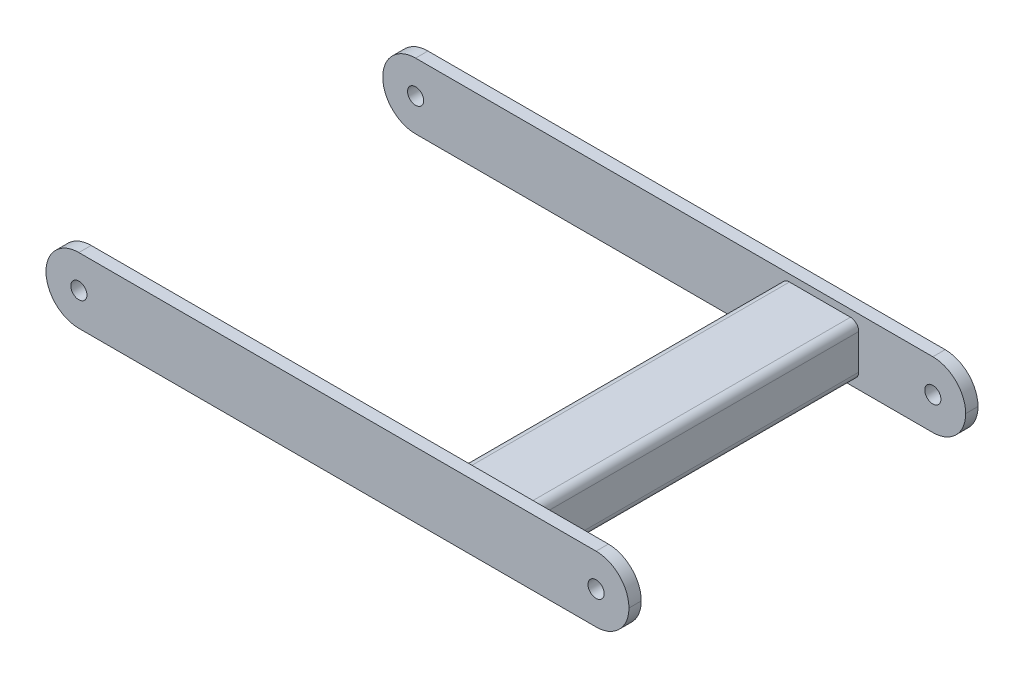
ISO-10303-21;
HEADER;
FILE_DESCRIPTION(('STEP AP214'),'2;1');
FILE_NAME('part.step','',(''),(''),'','','');
FILE_SCHEMA(('AUTOMOTIVE_DESIGN { 1 0 10303 214 1 1 1 1 }'));
ENDSEC;
DATA;
#1=APPLICATION_CONTEXT('core data for automotive mechanical design processes');
#2=APPLICATION_PROTOCOL_DEFINITION('international standard','automotive_design',2000,#1);
#3=PRODUCT_CONTEXT('',#1,'mechanical');
#4=PRODUCT('Part','Part','',(#3));
#5=PRODUCT_RELATED_PRODUCT_CATEGORY('part','',(#4));
#6=PRODUCT_DEFINITION_FORMATION('','',#4);
#7=PRODUCT_DEFINITION_CONTEXT('part definition',#1,'design');
#8=PRODUCT_DEFINITION('design','',#6,#7);
#9=PRODUCT_DEFINITION_SHAPE('','',#8);
#10=(LENGTH_UNIT() NAMED_UNIT(*) SI_UNIT(.MILLI.,.METRE.));
#11=(NAMED_UNIT(*) PLANE_ANGLE_UNIT() SI_UNIT($,.RADIAN.));
#12=(NAMED_UNIT(*) SI_UNIT($,.STERADIAN.) SOLID_ANGLE_UNIT());
#13=UNCERTAINTY_MEASURE_WITH_UNIT(LENGTH_MEASURE(1.E-05),#10,'distance_accuracy_value','');
#14=(GEOMETRIC_REPRESENTATION_CONTEXT(3) GLOBAL_UNCERTAINTY_ASSIGNED_CONTEXT((#13)) GLOBAL_UNIT_ASSIGNED_CONTEXT((#10,
#11,#12)) REPRESENTATION_CONTEXT('',''));
#15=CARTESIAN_POINT('',(0.,0.,0.));
#16=DIRECTION('',(0.,0.,1.));
#17=DIRECTION('',(1.,0.,0.));
#18=AXIS2_PLACEMENT_3D('',#15,#16,#17);
#19=CARTESIAN_POINT('',(314.557,13.5999999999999,125.475));
#20=DIRECTION('',(0.,0.,-1.));
#21=DIRECTION('',(-1.,0.,0.));
#22=AXIS2_PLACEMENT_3D('',#19,#20,#21);
#23=CYLINDRICAL_SURFACE('',#22,6.40000000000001);
#24=CARTESIAN_POINT('',(314.557,13.5999999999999,-125.475));
#25=DIRECTION('',(0.,0.,1.));
#26=DIRECTION('',(0.,1.,0.));
#27=AXIS2_PLACEMENT_3D('',#24,#25,#26);
#28=CIRCLE('',#27,6.40000000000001);
#29=CARTESIAN_POINT('',(314.557,20.,-125.475));
#30=VERTEX_POINT('',#29);
#31=CARTESIAN_POINT('',(308.157,13.5999999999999,-125.475));
#32=VERTEX_POINT('',#31);
#33=EDGE_CURVE('E252',#30,#32,#28,.T.);
#34=ORIENTED_EDGE('',*,*,#33,.T.);
#35=DIRECTION('',(0.,0.,-1.));
#36=VECTOR('',#35,1.);
#37=CARTESIAN_POINT('',(308.157,13.5999999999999,125.475));
#38=LINE('',#37,#36);
#39=CARTESIAN_POINT('',(308.157,13.5999999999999,125.475));
#40=VERTEX_POINT('',#39);
#41=EDGE_CURVE('E13',#40,#32,#38,.T.);
#42=ORIENTED_EDGE('',*,*,#41,.F.);
#43=CARTESIAN_POINT('',(314.557,13.5999999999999,125.475));
#44=DIRECTION('',(0.,0.,1.));
#45=DIRECTION('',(0.,1.,0.));
#46=AXIS2_PLACEMENT_3D('',#43,#44,#45);
#47=CIRCLE('',#46,6.40000000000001);
#48=CARTESIAN_POINT('',(314.557,20.,125.475));
#49=VERTEX_POINT('',#48);
#50=EDGE_CURVE('E330',#49,#40,#47,.T.);
#51=ORIENTED_EDGE('',*,*,#50,.F.);
#52=DIRECTION('',(0.,0.,-1.));
#53=VECTOR('',#52,1.);
#54=CARTESIAN_POINT('',(314.557,20.,125.475));
#55=LINE('',#54,#53);
#56=EDGE_CURVE('E267',#49,#30,#55,.T.);
#57=ORIENTED_EDGE('',*,*,#56,.T.);
#58=EDGE_LOOP('',(#34,#42,#51,#57));
#59=FACE_BOUND('',#58,.T.);
#60=ADVANCED_FACE('F80',(#59),#23,.T.);
#61=CARTESIAN_POINT('',(308.157,13.5999999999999,125.475));
#62=DIRECTION('',(1.,0.,0.));
#63=DIRECTION('',(0.,1.,0.));
#64=AXIS2_PLACEMENT_3D('',#61,#62,#63);
#65=PLANE('',#64);
#66=DIRECTION('',(0.,-1.,0.));
#67=VECTOR('',#66,1.);
#68=CARTESIAN_POINT('',(308.157,13.5999999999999,-125.475));
#69=LINE('',#68,#67);
#70=CARTESIAN_POINT('',(308.157,-13.6000000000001,-125.475));
#71=VERTEX_POINT('',#70);
#72=EDGE_CURVE('E255',#32,#71,#69,.T.);
#73=ORIENTED_EDGE('',*,*,#72,.T.);
#74=DIRECTION('',(0.,0.,-1.));
#75=VECTOR('',#74,1.);
#76=CARTESIAN_POINT('',(308.157,-13.6000000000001,125.475));
#77=LINE('',#76,#75);
#78=CARTESIAN_POINT('',(308.157,-13.6000000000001,125.475));
#79=VERTEX_POINT('',#78);
#80=EDGE_CURVE('E90',#79,#71,#77,.T.);
#81=ORIENTED_EDGE('',*,*,#80,.F.);
#82=DIRECTION('',(0.,-1.,0.));
#83=VECTOR('',#82,1.);
#84=CARTESIAN_POINT('',(308.157,13.5999999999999,125.475));
#85=LINE('',#84,#83);
#86=EDGE_CURVE('E332',#40,#79,#85,.T.);
#87=ORIENTED_EDGE('',*,*,#86,.F.);
#88=ORIENTED_EDGE('',*,*,#41,.T.);
#89=EDGE_LOOP('',(#73,#81,#87,#88));
#90=FACE_BOUND('',#89,.T.);
#91=ADVANCED_FACE('F367',(#90),#65,.F.);
#92=CARTESIAN_POINT('',(314.557,-13.6000000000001,125.475));
#93=DIRECTION('',(0.,0.,-1.));
#94=DIRECTION('',(-1.,0.,0.));
#95=AXIS2_PLACEMENT_3D('',#92,#93,#94);
#96=CYLINDRICAL_SURFACE('',#95,6.40000000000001);
#97=CARTESIAN_POINT('',(314.557,-13.6000000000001,-125.475));
#98=DIRECTION('',(0.,0.,1.));
#99=DIRECTION('',(0.,1.,0.));
#100=AXIS2_PLACEMENT_3D('',#97,#98,#99);
#101=CIRCLE('',#100,6.40000000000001);
#102=CARTESIAN_POINT('',(314.557,-20.0000000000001,-125.475));
#103=VERTEX_POINT('',#102);
#104=EDGE_CURVE('E257',#71,#103,#101,.T.);
#105=ORIENTED_EDGE('',*,*,#104,.T.);
#106=DIRECTION('',(0.,0.,-1.));
#107=VECTOR('',#106,1.);
#108=CARTESIAN_POINT('',(314.557,-20.0000000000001,125.475));
#109=LINE('',#108,#107);
#110=CARTESIAN_POINT('',(314.557,-20.0000000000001,125.475));
#111=VERTEX_POINT('',#110);
#112=EDGE_CURVE('E274',#111,#103,#109,.T.);
#113=ORIENTED_EDGE('',*,*,#112,.F.);
#114=CARTESIAN_POINT('',(314.557,-13.6000000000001,125.475));
#115=DIRECTION('',(0.,0.,1.));
#116=DIRECTION('',(0.,1.,0.));
#117=AXIS2_PLACEMENT_3D('',#114,#115,#116);
#118=CIRCLE('',#117,6.40000000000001);
#119=EDGE_CURVE('E334',#79,#111,#118,.T.);
#120=ORIENTED_EDGE('',*,*,#119,.F.);
#121=ORIENTED_EDGE('',*,*,#80,.T.);
#122=EDGE_LOOP('',(#105,#113,#120,#121));
#123=FACE_BOUND('',#122,.T.);
#124=ADVANCED_FACE('F372',(#123),#96,.T.);
#125=CARTESIAN_POINT('',(361.757,-20.,125.475));
#126=DIRECTION('',(0.,1.,0.));
#127=DIRECTION('',(-1.,0.,0.));
#128=AXIS2_PLACEMENT_3D('',#125,#126,#127);
#129=PLANE('',#128);
#130=DIRECTION('',(1.,0.,0.));
#131=VECTOR('',#130,1.);
#132=CARTESIAN_POINT('',(361.757,-20.,-125.475));
#133=LINE('',#132,#131);
#134=CARTESIAN_POINT('',(361.757,-20.,-125.475));
#135=VERTEX_POINT('',#134);
#136=EDGE_CURVE('E259',#103,#135,#133,.T.);
#137=ORIENTED_EDGE('',*,*,#136,.T.);
#138=DIRECTION('',(0.,0.,-1.));
#139=VECTOR('',#138,1.);
#140=CARTESIAN_POINT('',(361.757,-20.,125.475));
#141=LINE('',#140,#139);
#142=CARTESIAN_POINT('',(361.757,-20.,125.475));
#143=VERTEX_POINT('',#142);
#144=EDGE_CURVE('E271',#143,#135,#141,.T.);
#145=ORIENTED_EDGE('',*,*,#144,.F.);
#146=DIRECTION('',(1.,0.,0.));
#147=VECTOR('',#146,1.);
#148=CARTESIAN_POINT('',(361.757,-20.,125.475));
#149=LINE('',#148,#147);
#150=EDGE_CURVE('E336',#111,#143,#149,.T.);
#151=ORIENTED_EDGE('',*,*,#150,.F.);
#152=ORIENTED_EDGE('',*,*,#112,.T.);
#153=EDGE_LOOP('',(#137,#145,#151,#152));
#154=FACE_BOUND('',#153,.T.);
#155=ADVANCED_FACE('F342',(#154),#129,.F.);
#156=CARTESIAN_POINT('',(361.757,-13.5999999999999,125.475));
#157=DIRECTION('',(0.,0.,-1.));
#158=DIRECTION('',(-1.,0.,0.));
#159=AXIS2_PLACEMENT_3D('',#156,#157,#158);
#160=CYLINDRICAL_SURFACE('',#159,6.40000000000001);
#161=CARTESIAN_POINT('',(361.757,-13.5999999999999,-125.475));
#162=DIRECTION('',(0.,0.,1.));
#163=DIRECTION('',(0.,1.,0.));
#164=AXIS2_PLACEMENT_3D('',#161,#162,#163);
#165=CIRCLE('',#164,6.40000000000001);
#166=CARTESIAN_POINT('',(368.157,-13.5999999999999,-125.475));
#167=VERTEX_POINT('',#166);
#168=EDGE_CURVE('E261',#135,#167,#165,.T.);
#169=ORIENTED_EDGE('',*,*,#168,.T.);
#170=DIRECTION('',(0.,0.,-1.));
#171=VECTOR('',#170,1.);
#172=CARTESIAN_POINT('',(368.157,-13.5999999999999,125.475));
#173=LINE('',#172,#171);
#174=CARTESIAN_POINT('',(368.157,-13.5999999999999,125.475));
#175=VERTEX_POINT('',#174);
#176=EDGE_CURVE('E219',#175,#167,#173,.T.);
#177=ORIENTED_EDGE('',*,*,#176,.F.);
#178=CARTESIAN_POINT('',(361.757,-13.5999999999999,125.475));
#179=DIRECTION('',(0.,0.,1.));
#180=DIRECTION('',(0.,1.,0.));
#181=AXIS2_PLACEMENT_3D('',#178,#179,#180);
#182=CIRCLE('',#181,6.40000000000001);
#183=EDGE_CURVE('E210',#143,#175,#182,.T.);
#184=ORIENTED_EDGE('',*,*,#183,.F.);
#185=ORIENTED_EDGE('',*,*,#144,.T.);
#186=EDGE_LOOP('',(#169,#177,#184,#185));
#187=FACE_BOUND('',#186,.T.);
#188=ADVANCED_FACE('F346',(#187),#160,.T.);
#189=CARTESIAN_POINT('',(368.157,-13.5999999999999,125.475));
#190=DIRECTION('',(-1.,0.,0.));
#191=DIRECTION('',(0.,-1.,0.));
#192=AXIS2_PLACEMENT_3D('',#189,#190,#191);
#193=PLANE('',#192);
#194=DIRECTION('',(0.,1.,0.));
#195=VECTOR('',#194,1.);
#196=CARTESIAN_POINT('',(368.157,-13.5999999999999,-125.475));
#197=LINE('',#196,#195);
#198=CARTESIAN_POINT('',(368.157,13.6000000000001,-125.475));
#199=VERTEX_POINT('',#198);
#200=EDGE_CURVE('E218',#167,#199,#197,.T.);
#201=ORIENTED_EDGE('',*,*,#200,.T.);
#202=DIRECTION('',(0.,0.,-1.));
#203=VECTOR('',#202,1.);
#204=CARTESIAN_POINT('',(368.157,13.6000000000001,125.475));
#205=LINE('',#204,#203);
#206=CARTESIAN_POINT('',(368.157,13.6000000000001,125.475));
#207=VERTEX_POINT('',#206);
#208=EDGE_CURVE('E215',#207,#199,#205,.T.);
#209=ORIENTED_EDGE('',*,*,#208,.F.);
#210=DIRECTION('',(0.,1.,0.));
#211=VECTOR('',#210,1.);
#212=CARTESIAN_POINT('',(368.157,-13.5999999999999,125.475));
#213=LINE('',#212,#211);
#214=EDGE_CURVE('E204',#175,#207,#213,.T.);
#215=ORIENTED_EDGE('',*,*,#214,.F.);
#216=ORIENTED_EDGE('',*,*,#176,.T.);
#217=EDGE_LOOP('',(#201,#209,#215,#216));
#218=FACE_BOUND('',#217,.T.);
#219=ADVANCED_FACE('F216',(#218),#193,.F.);
#220=CARTESIAN_POINT('',(361.757,13.6000000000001,125.475));
#221=DIRECTION('',(0.,0.,-1.));
#222=DIRECTION('',(-1.,0.,0.));
#223=AXIS2_PLACEMENT_3D('',#220,#221,#222);
#224=CYLINDRICAL_SURFACE('',#223,6.40000000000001);
#225=CARTESIAN_POINT('',(361.757,13.6000000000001,-125.475));
#226=DIRECTION('',(0.,0.,1.));
#227=DIRECTION('',(0.,1.,0.));
#228=AXIS2_PLACEMENT_3D('',#225,#226,#227);
#229=CIRCLE('',#228,6.40000000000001);
#230=CARTESIAN_POINT('',(361.757,20.0000000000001,-125.475));
#231=VERTEX_POINT('',#230);
#232=EDGE_CURVE('E152',#199,#231,#229,.T.);
#233=ORIENTED_EDGE('',*,*,#232,.T.);
#234=DIRECTION('',(0.,0.,-1.));
#235=VECTOR('',#234,1.);
#236=CARTESIAN_POINT('',(361.757,20.0000000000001,125.475));
#237=LINE('',#236,#235);
#238=CARTESIAN_POINT('',(361.757,20.0000000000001,125.475));
#239=VERTEX_POINT('',#238);
#240=EDGE_CURVE('E220',#239,#231,#237,.T.);
#241=ORIENTED_EDGE('',*,*,#240,.F.);
#242=CARTESIAN_POINT('',(361.757,13.6000000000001,125.475));
#243=DIRECTION('',(0.,0.,1.));
#244=DIRECTION('',(0.,1.,0.));
#245=AXIS2_PLACEMENT_3D('',#242,#243,#244);
#246=CIRCLE('',#245,6.40000000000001);
#247=EDGE_CURVE('E208',#207,#239,#246,.T.);
#248=ORIENTED_EDGE('',*,*,#247,.F.);
#249=ORIENTED_EDGE('',*,*,#208,.T.);
#250=EDGE_LOOP('',(#233,#241,#248,#249));
#251=FACE_BOUND('',#250,.T.);
#252=ADVANCED_FACE('F222',(#251),#224,.T.);
#253=CARTESIAN_POINT('',(314.557,-13.6000000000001,125.475));
#254=DIRECTION('',(0.,0.,-1.));
#255=DIRECTION('',(-1.,0.,0.));
#256=AXIS2_PLACEMENT_3D('',#253,#254,#255);
#257=CYLINDRICAL_SURFACE('',#256,3.19999999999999);
#258=CARTESIAN_POINT('',(314.557,-13.6000000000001,-125.475));
#259=DIRECTION('',(0.,0.,1.));
#260=DIRECTION('',(0.,1.,0.));
#261=AXIS2_PLACEMENT_3D('',#258,#259,#260);
#262=CIRCLE('',#261,3.19999999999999);
#263=CARTESIAN_POINT('',(311.357,-13.6000000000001,-125.475));
#264=VERTEX_POINT('',#263);
#265=CARTESIAN_POINT('',(314.557,-16.8,-125.475));
#266=VERTEX_POINT('',#265);
#267=EDGE_CURVE('E228',#264,#266,#262,.T.);
#268=ORIENTED_EDGE('',*,*,#267,.F.);
#269=DIRECTION('',(0.,0.,-1.));
#270=VECTOR('',#269,1.);
#271=CARTESIAN_POINT('',(311.357,-13.6000000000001,125.475));
#272=LINE('',#271,#270);
#273=CARTESIAN_POINT('',(311.357,-13.6000000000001,125.475));
#274=VERTEX_POINT('',#273);
#275=EDGE_CURVE('E84',#274,#264,#272,.T.);
#276=ORIENTED_EDGE('',*,*,#275,.F.);
#277=CARTESIAN_POINT('',(314.557,-13.6000000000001,125.475));
#278=DIRECTION('',(0.,0.,1.));
#279=DIRECTION('',(0.,1.,0.));
#280=AXIS2_PLACEMENT_3D('',#277,#278,#279);
#281=CIRCLE('',#280,3.19999999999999);
#282=CARTESIAN_POINT('',(314.557,-16.8,125.475));
#283=VERTEX_POINT('',#282);
#284=EDGE_CURVE('E266',#274,#283,#281,.T.);
#285=ORIENTED_EDGE('',*,*,#284,.T.);
#286=DIRECTION('',(0.,0.,-1.));
#287=VECTOR('',#286,1.);
#288=CARTESIAN_POINT('',(314.557,-16.8,125.475));
#289=LINE('',#288,#287);
#290=EDGE_CURVE('E224',#283,#266,#289,.T.);
#291=ORIENTED_EDGE('',*,*,#290,.T.);
#292=EDGE_LOOP('',(#268,#276,#285,#291));
#293=FACE_BOUND('',#292,.T.);
#294=ADVANCED_FACE('F82',(#293),#257,.F.);
#295=CARTESIAN_POINT('',(311.357,13.5999999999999,125.475));
#296=DIRECTION('',(1.,0.,0.));
#297=DIRECTION('',(0.,1.,0.));
#298=AXIS2_PLACEMENT_3D('',#295,#296,#297);
#299=PLANE('',#298);
#300=DIRECTION('',(0.,-1.,0.));
#301=VECTOR('',#300,1.);
#302=CARTESIAN_POINT('',(311.357,13.5999999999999,-125.475));
#303=LINE('',#302,#301);
#304=CARTESIAN_POINT('',(311.357,13.5999999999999,-125.475));
#305=VERTEX_POINT('',#304);
#306=EDGE_CURVE('E231',#305,#264,#303,.T.);
#307=ORIENTED_EDGE('',*,*,#306,.F.);
#308=DIRECTION('',(0.,0.,-1.));
#309=VECTOR('',#308,1.);
#310=CARTESIAN_POINT('',(311.357,13.5999999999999,125.475));
#311=LINE('',#310,#309);
#312=CARTESIAN_POINT('',(311.357,13.5999999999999,125.475));
#313=VERTEX_POINT('',#312);
#314=EDGE_CURVE('E289',#313,#305,#311,.T.);
#315=ORIENTED_EDGE('',*,*,#314,.F.);
#316=DIRECTION('',(0.,-1.,0.));
#317=VECTOR('',#316,1.);
#318=CARTESIAN_POINT('',(311.357,13.5999999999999,125.475));
#319=LINE('',#318,#317);
#320=EDGE_CURVE('E298',#313,#274,#319,.T.);
#321=ORIENTED_EDGE('',*,*,#320,.T.);
#322=ORIENTED_EDGE('',*,*,#275,.T.);
#323=EDGE_LOOP('',(#307,#315,#321,#322));
#324=FACE_BOUND('',#323,.T.);
#325=ADVANCED_FACE('F296',(#324),#299,.T.);
#326=CARTESIAN_POINT('',(314.557,13.5999999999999,125.475));
#327=DIRECTION('',(0.,0.,-1.));
#328=DIRECTION('',(-1.,0.,0.));
#329=AXIS2_PLACEMENT_3D('',#326,#327,#328);
#330=CYLINDRICAL_SURFACE('',#329,3.20000000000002);
#331=CARTESIAN_POINT('',(314.557,13.5999999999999,-125.475));
#332=DIRECTION('',(0.,0.,1.));
#333=DIRECTION('',(0.,1.,0.));
#334=AXIS2_PLACEMENT_3D('',#331,#332,#333);
#335=CIRCLE('',#334,3.20000000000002);
#336=CARTESIAN_POINT('',(314.557,16.8,-125.475));
#337=VERTEX_POINT('',#336);
#338=EDGE_CURVE('E234',#337,#305,#335,.T.);
#339=ORIENTED_EDGE('',*,*,#338,.F.);
#340=DIRECTION('',(0.,0.,-1.));
#341=VECTOR('',#340,1.);
#342=CARTESIAN_POINT('',(314.557,16.8,125.475));
#343=LINE('',#342,#341);
#344=CARTESIAN_POINT('',(314.557,16.8,125.475));
#345=VERTEX_POINT('',#344);
#346=EDGE_CURVE('E288',#345,#337,#343,.T.);
#347=ORIENTED_EDGE('',*,*,#346,.F.);
#348=CARTESIAN_POINT('',(314.557,13.5999999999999,125.475));
#349=DIRECTION('',(0.,0.,1.));
#350=DIRECTION('',(0.,1.,0.));
#351=AXIS2_PLACEMENT_3D('',#348,#349,#350);
#352=CIRCLE('',#351,3.20000000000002);
#353=EDGE_CURVE('E306',#345,#313,#352,.T.);
#354=ORIENTED_EDGE('',*,*,#353,.T.);
#355=ORIENTED_EDGE('',*,*,#314,.T.);
#356=EDGE_LOOP('',(#339,#347,#354,#355));
#357=FACE_BOUND('',#356,.T.);
#358=ADVANCED_FACE('F304',(#357),#330,.F.);
#359=CARTESIAN_POINT('',(314.557,16.8,125.475));
#360=DIRECTION('',(0.,-1.,0.));
#361=DIRECTION('',(1.,0.,0.));
#362=AXIS2_PLACEMENT_3D('',#359,#360,#361);
#363=PLANE('',#362);
#364=DIRECTION('',(-1.,0.,0.));
#365=VECTOR('',#364,1.);
#366=CARTESIAN_POINT('',(314.557,16.8,-125.475));
#367=LINE('',#366,#365);
#368=CARTESIAN_POINT('',(361.757,16.8000000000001,-125.475));
#369=VERTEX_POINT('',#368);
#370=EDGE_CURVE('E237',#369,#337,#367,.T.);
#371=ORIENTED_EDGE('',*,*,#370,.F.);
#372=DIRECTION('',(0.,0.,-1.));
#373=VECTOR('',#372,1.);
#374=CARTESIAN_POINT('',(361.757,16.8000000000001,125.475));
#375=LINE('',#374,#373);
#376=CARTESIAN_POINT('',(361.757,16.8000000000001,125.475));
#377=VERTEX_POINT('',#376);
#378=EDGE_CURVE('E286',#377,#369,#375,.T.);
#379=ORIENTED_EDGE('',*,*,#378,.F.);
#380=DIRECTION('',(-1.,0.,0.));
#381=VECTOR('',#380,1.);
#382=CARTESIAN_POINT('',(314.557,16.8,125.475));
#383=LINE('',#382,#381);
#384=EDGE_CURVE('E312',#377,#345,#383,.T.);
#385=ORIENTED_EDGE('',*,*,#384,.T.);
#386=ORIENTED_EDGE('',*,*,#346,.T.);
#387=EDGE_LOOP('',(#371,#379,#385,#386));
#388=FACE_BOUND('',#387,.T.);
#389=ADVANCED_FACE('F315',(#388),#363,.T.);
#390=CARTESIAN_POINT('',(361.757,13.6000000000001,125.475));
#391=DIRECTION('',(0.,0.,-1.));
#392=DIRECTION('',(-1.,0.,0.));
#393=AXIS2_PLACEMENT_3D('',#390,#391,#392);
#394=CYLINDRICAL_SURFACE('',#393,3.20000000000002);
#395=CARTESIAN_POINT('',(361.757,13.6000000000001,-125.475));
#396=DIRECTION('',(0.,0.,1.));
#397=DIRECTION('',(0.,1.,0.));
#398=AXIS2_PLACEMENT_3D('',#395,#396,#397);
#399=CIRCLE('',#398,3.20000000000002);
#400=CARTESIAN_POINT('',(364.957,13.6000000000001,-125.475));
#401=VERTEX_POINT('',#400);
#402=EDGE_CURVE('E240',#401,#369,#399,.T.);
#403=ORIENTED_EDGE('',*,*,#402,.F.);
#404=DIRECTION('',(0.,0.,-1.));
#405=VECTOR('',#404,1.);
#406=CARTESIAN_POINT('',(364.957,13.6000000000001,125.475));
#407=LINE('',#406,#405);
#408=CARTESIAN_POINT('',(364.957,13.6000000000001,125.475));
#409=VERTEX_POINT('',#408);
#410=EDGE_CURVE('E284',#409,#401,#407,.T.);
#411=ORIENTED_EDGE('',*,*,#410,.F.);
#412=CARTESIAN_POINT('',(361.757,13.6000000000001,125.475));
#413=DIRECTION('',(0.,0.,1.));
#414=DIRECTION('',(0.,1.,0.));
#415=AXIS2_PLACEMENT_3D('',#412,#413,#414);
#416=CIRCLE('',#415,3.20000000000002);
#417=EDGE_CURVE('E316',#409,#377,#416,.T.);
#418=ORIENTED_EDGE('',*,*,#417,.T.);
#419=ORIENTED_EDGE('',*,*,#378,.T.);
#420=EDGE_LOOP('',(#403,#411,#418,#419));
#421=FACE_BOUND('',#420,.T.);
#422=ADVANCED_FACE('F383',(#421),#394,.F.);
#423=CARTESIAN_POINT('',(364.957,-13.5999999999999,125.475));
#424=DIRECTION('',(-1.,0.,0.));
#425=DIRECTION('',(0.,-1.,0.));
#426=AXIS2_PLACEMENT_3D('',#423,#424,#425);
#427=PLANE('',#426);
#428=DIRECTION('',(0.,1.,0.));
#429=VECTOR('',#428,1.);
#430=CARTESIAN_POINT('',(364.957,-13.5999999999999,-125.475));
#431=LINE('',#430,#429);
#432=CARTESIAN_POINT('',(364.957,-13.5999999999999,-125.475));
#433=VERTEX_POINT('',#432);
#434=EDGE_CURVE('E243',#433,#401,#431,.T.);
#435=ORIENTED_EDGE('',*,*,#434,.F.);
#436=DIRECTION('',(0.,0.,-1.));
#437=VECTOR('',#436,1.);
#438=CARTESIAN_POINT('',(364.957,-13.5999999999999,125.475));
#439=LINE('',#438,#437);
#440=CARTESIAN_POINT('',(364.957,-13.5999999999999,125.475));
#441=VERTEX_POINT('',#440);
#442=EDGE_CURVE('E282',#441,#433,#439,.T.);
#443=ORIENTED_EDGE('',*,*,#442,.F.);
#444=DIRECTION('',(0.,1.,0.));
#445=VECTOR('',#444,1.);
#446=CARTESIAN_POINT('',(364.957,-13.5999999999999,125.475));
#447=LINE('',#446,#445);
#448=EDGE_CURVE('E318',#441,#409,#447,.T.);
#449=ORIENTED_EDGE('',*,*,#448,.T.);
#450=ORIENTED_EDGE('',*,*,#410,.T.);
#451=EDGE_LOOP('',(#435,#443,#449,#450));
#452=FACE_BOUND('',#451,.T.);
#453=ADVANCED_FACE('F379',(#452),#427,.T.);
#454=CARTESIAN_POINT('',(361.757,-13.5999999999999,125.475));
#455=DIRECTION('',(0.,0.,-1.));
#456=DIRECTION('',(-1.,0.,0.));
#457=AXIS2_PLACEMENT_3D('',#454,#455,#456);
#458=CYLINDRICAL_SURFACE('',#457,3.19999999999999);
#459=CARTESIAN_POINT('',(361.757,-13.5999999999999,-125.475));
#460=DIRECTION('',(0.,0.,1.));
#461=DIRECTION('',(0.,1.,0.));
#462=AXIS2_PLACEMENT_3D('',#459,#460,#461);
#463=CIRCLE('',#462,3.19999999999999);
#464=CARTESIAN_POINT('',(361.757,-16.7999999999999,-125.475));
#465=VERTEX_POINT('',#464);
#466=EDGE_CURVE('E246',#465,#433,#463,.T.);
#467=ORIENTED_EDGE('',*,*,#466,.F.);
#468=DIRECTION('',(0.,0.,-1.));
#469=VECTOR('',#468,1.);
#470=CARTESIAN_POINT('',(361.757,-16.7999999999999,125.475));
#471=LINE('',#470,#469);
#472=CARTESIAN_POINT('',(361.757,-16.7999999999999,125.475));
#473=VERTEX_POINT('',#472);
#474=EDGE_CURVE('E280',#473,#465,#471,.T.);
#475=ORIENTED_EDGE('',*,*,#474,.F.);
#476=CARTESIAN_POINT('',(361.757,-13.5999999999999,125.475));
#477=DIRECTION('',(0.,0.,1.));
#478=DIRECTION('',(0.,1.,0.));
#479=AXIS2_PLACEMENT_3D('',#476,#477,#478);
#480=CIRCLE('',#479,3.19999999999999);
#481=EDGE_CURVE('E324',#473,#441,#480,.T.);
#482=ORIENTED_EDGE('',*,*,#481,.T.);
#483=ORIENTED_EDGE('',*,*,#442,.T.);
#484=EDGE_LOOP('',(#467,#475,#482,#483));
#485=FACE_BOUND('',#484,.T.);
#486=ADVANCED_FACE('F361',(#485),#458,.F.);
#487=CARTESIAN_POINT('',(361.757,-16.7999999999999,125.475));
#488=DIRECTION('',(0.,1.,0.));
#489=DIRECTION('',(-1.,0.,0.));
#490=AXIS2_PLACEMENT_3D('',#487,#488,#489);
#491=PLANE('',#490);
#492=DIRECTION('',(1.,0.,0.));
#493=VECTOR('',#492,1.);
#494=CARTESIAN_POINT('',(361.757,-16.7999999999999,-125.475));
#495=LINE('',#494,#493);
#496=EDGE_CURVE('E249',#266,#465,#495,.T.);
#497=ORIENTED_EDGE('',*,*,#496,.F.);
#498=ORIENTED_EDGE('',*,*,#290,.F.);
#499=DIRECTION('',(1.,0.,0.));
#500=VECTOR('',#499,1.);
#501=CARTESIAN_POINT('',(361.757,-16.7999999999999,125.475));
#502=LINE('',#501,#500);
#503=EDGE_CURVE('E327',#283,#473,#502,.T.);
#504=ORIENTED_EDGE('',*,*,#503,.T.);
#505=ORIENTED_EDGE('',*,*,#474,.T.);
#506=EDGE_LOOP('',(#497,#498,#504,#505));
#507=FACE_BOUND('',#506,.T.);
#508=ADVANCED_FACE('F354',(#507),#491,.T.);
#509=CARTESIAN_POINT('',(314.557,20.,125.475));
#510=DIRECTION('',(0.,-1.,0.));
#511=DIRECTION('',(1.,0.,0.));
#512=AXIS2_PLACEMENT_3D('',#509,#510,#511);
#513=PLANE('',#512);
#514=DIRECTION('',(-1.,0.,0.));
#515=VECTOR('',#514,1.);
#516=CARTESIAN_POINT('',(314.557,20.,-125.475));
#517=LINE('',#516,#515);
#518=EDGE_CURVE('E158',#231,#30,#517,.T.);
#519=ORIENTED_EDGE('',*,*,#518,.T.);
#520=ORIENTED_EDGE('',*,*,#56,.F.);
#521=DIRECTION('',(-1.,0.,0.));
#522=VECTOR('',#521,1.);
#523=CARTESIAN_POINT('',(314.557,20.,125.475));
#524=LINE('',#523,#522);
#525=EDGE_CURVE('E99',#239,#49,#524,.T.);
#526=ORIENTED_EDGE('',*,*,#525,.F.);
#527=ORIENTED_EDGE('',*,*,#240,.T.);
#528=EDGE_LOOP('',(#519,#520,#526,#527));
#529=FACE_BOUND('',#528,.T.);
#530=ADVANCED_FACE('F352',(#529),#513,.F.);
#531=CARTESIAN_POINT('',(314.557,13.5999999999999,125.475));
#532=DIRECTION('',(0.,0.,1.));
#533=DIRECTION('',(0.,1.,0.));
#534=AXIS2_PLACEMENT_3D('',#531,#532,#533);
#535=PLANE('',#534);
#536=ORIENTED_EDGE('',*,*,#284,.F.);
#537=ORIENTED_EDGE('',*,*,#320,.F.);
#538=ORIENTED_EDGE('',*,*,#353,.F.);
#539=ORIENTED_EDGE('',*,*,#384,.F.);
#540=ORIENTED_EDGE('',*,*,#417,.F.);
#541=ORIENTED_EDGE('',*,*,#448,.F.);
#542=ORIENTED_EDGE('',*,*,#481,.F.);
#543=ORIENTED_EDGE('',*,*,#503,.F.);
#544=EDGE_LOOP('',(#536,#537,#538,#539,#540,#541,#542,#543));
#545=FACE_BOUND('',#544,.T.);
#546=ORIENTED_EDGE('',*,*,#50,.T.);
#547=ORIENTED_EDGE('',*,*,#86,.T.);
#548=ORIENTED_EDGE('',*,*,#119,.T.);
#549=ORIENTED_EDGE('',*,*,#150,.T.);
#550=ORIENTED_EDGE('',*,*,#183,.T.);
#551=ORIENTED_EDGE('',*,*,#214,.T.);
#552=ORIENTED_EDGE('',*,*,#247,.T.);
#553=ORIENTED_EDGE('',*,*,#525,.T.);
#554=EDGE_LOOP('',(#546,#547,#548,#549,#550,#551,#552,#553));
#555=FACE_BOUND('',#554,.T.);
#556=ADVANCED_FACE('F206',(#545,#555),#535,.T.);
#557=CARTESIAN_POINT('',(314.557,13.5999999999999,-125.475));
#558=DIRECTION('',(0.,0.,1.));
#559=DIRECTION('',(0.,1.,0.));
#560=AXIS2_PLACEMENT_3D('',#557,#558,#559);
#561=PLANE('',#560);
#562=ORIENTED_EDGE('',*,*,#267,.T.);
#563=ORIENTED_EDGE('',*,*,#496,.T.);
#564=ORIENTED_EDGE('',*,*,#466,.T.);
#565=ORIENTED_EDGE('',*,*,#434,.T.);
#566=ORIENTED_EDGE('',*,*,#402,.T.);
#567=ORIENTED_EDGE('',*,*,#370,.T.);
#568=ORIENTED_EDGE('',*,*,#338,.T.);
#569=ORIENTED_EDGE('',*,*,#306,.T.);
#570=EDGE_LOOP('',(#562,#563,#564,#565,#566,#567,#568,#569));
#571=FACE_BOUND('',#570,.T.);
#572=ORIENTED_EDGE('',*,*,#33,.F.);
#573=ORIENTED_EDGE('',*,*,#518,.F.);
#574=ORIENTED_EDGE('',*,*,#232,.F.);
#575=ORIENTED_EDGE('',*,*,#200,.F.);
#576=ORIENTED_EDGE('',*,*,#168,.F.);
#577=ORIENTED_EDGE('',*,*,#136,.F.);
#578=ORIENTED_EDGE('',*,*,#104,.F.);
#579=ORIENTED_EDGE('',*,*,#72,.F.);
#580=EDGE_LOOP('',(#572,#573,#574,#575,#576,#577,#578,#579));
#581=FACE_BOUND('',#580,.T.);
#582=ADVANCED_FACE('F301',(#571,#581),#561,.F.);
#583=CLOSED_SHELL('',(#60,#91,#124,#155,#188,#219,#252,#294,#325,#358,#389,#422,#453,#486,#508,
#530,#556,#582));
#584=MANIFOLD_SOLID_BREP('B2',#583);
#585=CARTESIAN_POINT('',(450.876,25.4000000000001,135.));
#586=DIRECTION('',(0.,0.,-1.));
#587=DIRECTION('',(0.,-1.,0.));
#588=AXIS2_PLACEMENT_3D('',#585,#586,#587);
#589=PLANE('',#588);
#590=DIRECTION('',(-1.,0.,0.));
#591=VECTOR('',#590,1.);
#592=CARTESIAN_POINT('',(450.876,-25.3999999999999,135.));
#593=LINE('',#592,#591);
#594=CARTESIAN_POINT('',(425.476,-25.3999999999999,135.));
#595=VERTEX_POINT('',#594);
#596=CARTESIAN_POINT('',(25.4,-25.3999999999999,135.));
#597=VERTEX_POINT('',#596);
#598=EDGE_CURVE('E622',#595,#597,#593,.T.);
#599=ORIENTED_EDGE('',*,*,#598,.F.);
#600=CARTESIAN_POINT('',(425.476,0.,135.));
#601=DIRECTION('',(0.,0.,1.));
#602=DIRECTION('',(0.,-1.,0.));
#603=AXIS2_PLACEMENT_3D('',#600,#601,#602);
#604=CIRCLE('',#603,25.4);
#605=CARTESIAN_POINT('',(450.876,0.,135.));
#606=VERTEX_POINT('',#605);
#607=EDGE_CURVE('E632',#606,#595,#604,.F.);
#608=ORIENTED_EDGE('',*,*,#607,.F.);
#609=CARTESIAN_POINT('',(425.476,0.,135.));
#610=DIRECTION('',(0.,0.,1.));
#611=DIRECTION('',(0.,-1.,0.));
#612=AXIS2_PLACEMENT_3D('',#609,#610,#611);
#613=CIRCLE('',#612,25.4);
#614=CARTESIAN_POINT('',(425.476,25.4000000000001,135.));
#615=VERTEX_POINT('',#614);
#616=EDGE_CURVE('E639',#615,#606,#613,.F.);
#617=ORIENTED_EDGE('',*,*,#616,.F.);
#618=DIRECTION('',(-1.,0.,0.));
#619=VECTOR('',#618,1.);
#620=CARTESIAN_POINT('',(450.876,25.4000000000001,135.));
#621=LINE('',#620,#619);
#622=CARTESIAN_POINT('',(25.4,25.4000000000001,135.));
#623=VERTEX_POINT('',#622);
#624=EDGE_CURVE('E629',#615,#623,#621,.T.);
#625=ORIENTED_EDGE('',*,*,#624,.T.);
#626=CARTESIAN_POINT('',(25.4,0.,135.));
#627=DIRECTION('',(0.,0.,1.));
#628=DIRECTION('',(0.,-1.,0.));
#629=AXIS2_PLACEMENT_3D('',#626,#627,#628);
#630=CIRCLE('',#629,25.4);
#631=CARTESIAN_POINT('',(0.,0.,135.));
#632=VERTEX_POINT('',#631);
#633=EDGE_CURVE('E638',#632,#623,#630,.F.);
#634=ORIENTED_EDGE('',*,*,#633,.F.);
#635=CARTESIAN_POINT('',(25.4,0.,135.));
#636=DIRECTION('',(0.,0.,1.));
#637=DIRECTION('',(0.,-1.,0.));
#638=AXIS2_PLACEMENT_3D('',#635,#636,#637);
#639=CIRCLE('',#638,25.4);
#640=EDGE_CURVE('E645',#597,#632,#639,.F.);
#641=ORIENTED_EDGE('',*,*,#640,.F.);
#642=EDGE_LOOP('',(#599,#608,#617,#625,#634,#641));
#643=FACE_BOUND('',#642,.T.);
#644=CARTESIAN_POINT('',(425.476,0.,135.));
#645=DIRECTION('',(0.,0.,1.));
#646=DIRECTION('',(1.,0.,0.));
#647=AXIS2_PLACEMENT_3D('',#644,#645,#646);
#648=CIRCLE('',#647,6.24999999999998);
#649=CARTESIAN_POINT('',(431.726,0.,135.));
#650=VERTEX_POINT('',#649);
#651=EDGE_CURVE('E652',#650,#650,#648,.T.);
#652=ORIENTED_EDGE('',*,*,#651,.F.);
#653=EDGE_LOOP('',(#652));
#654=FACE_BOUND('',#653,.T.);
#655=CARTESIAN_POINT('',(25.4,0.,135.));
#656=DIRECTION('',(0.,0.,1.));
#657=DIRECTION('',(1.,0.,0.));
#658=AXIS2_PLACEMENT_3D('',#655,#656,#657);
#659=CIRCLE('',#658,6.24999999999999);
#660=CARTESIAN_POINT('',(31.65,0.,135.));
#661=VERTEX_POINT('',#660);
#662=EDGE_CURVE('E681',#661,#661,#659,.T.);
#663=ORIENTED_EDGE('',*,*,#662,.F.);
#664=EDGE_LOOP('',(#663));
#665=FACE_BOUND('',#664,.T.);
#666=ADVANCED_FACE('F563',(#643,#654,#665),#589,.F.);
#667=CARTESIAN_POINT('',(450.876,25.4000000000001,125.475));
#668=DIRECTION('',(0.,-1.,0.));
#669=DIRECTION('',(0.,0.,1.));
#670=AXIS2_PLACEMENT_3D('',#667,#668,#669);
#671=PLANE('',#670);
#672=ORIENTED_EDGE('',*,*,#624,.F.);
#673=DIRECTION('',(0.,0.,-1.));
#674=VECTOR('',#673,1.);
#675=CARTESIAN_POINT('',(425.476,25.4000000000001,135.));
#676=LINE('',#675,#674);
#677=CARTESIAN_POINT('',(425.476,25.4000000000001,125.475));
#678=VERTEX_POINT('',#677);
#679=EDGE_CURVE('E572',#678,#615,#676,.F.);
#680=ORIENTED_EDGE('',*,*,#679,.F.);
#681=DIRECTION('',(-1.,0.,0.));
#682=VECTOR('',#681,1.);
#683=CARTESIAN_POINT('',(450.876,25.4000000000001,125.475));
#684=LINE('',#683,#682);
#685=CARTESIAN_POINT('',(25.4,25.4000000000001,125.475));
#686=VERTEX_POINT('',#685);
#687=EDGE_CURVE('E648',#678,#686,#684,.T.);
#688=ORIENTED_EDGE('',*,*,#687,.T.);
#689=DIRECTION('',(0.,0.,-1.));
#690=VECTOR('',#689,1.);
#691=CARTESIAN_POINT('',(25.4,25.4000000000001,125.475));
#692=LINE('',#691,#690);
#693=EDGE_CURVE('E78',#623,#686,#692,.T.);
#694=ORIENTED_EDGE('',*,*,#693,.F.);
#695=EDGE_LOOP('',(#672,#680,#688,#694));
#696=FACE_BOUND('',#695,.T.);
#697=ADVANCED_FACE('F691',(#696),#671,.F.);
#698=CARTESIAN_POINT('',(450.876,25.4000000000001,125.475));
#699=DIRECTION('',(0.,0.,1.));
#700=DIRECTION('',(-1.,0.,0.));
#701=AXIS2_PLACEMENT_3D('',#698,#699,#700);
#702=PLANE('',#701);
#703=CARTESIAN_POINT('',(25.4,0.,125.475));
#704=DIRECTION('',(0.,0.,1.));
#705=DIRECTION('',(1.,0.,0.));
#706=AXIS2_PLACEMENT_3D('',#703,#704,#705);
#707=CIRCLE('',#706,6.24999999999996);
#708=CARTESIAN_POINT('',(31.6499999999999,0.,125.475));
#709=VERTEX_POINT('',#708);
#710=EDGE_CURVE('E567',#709,#709,#707,.T.);
#711=ORIENTED_EDGE('',*,*,#710,.T.);
#712=EDGE_LOOP('',(#711));
#713=FACE_BOUND('',#712,.T.);
#714=CARTESIAN_POINT('',(425.476,0.,125.475));
#715=DIRECTION('',(0.,0.,1.));
#716=DIRECTION('',(1.,0.,0.));
#717=AXIS2_PLACEMENT_3D('',#714,#715,#716);
#718=CIRCLE('',#717,6.24999999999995);
#719=CARTESIAN_POINT('',(431.726,0.,125.475));
#720=VERTEX_POINT('',#719);
#721=EDGE_CURVE('E672',#720,#720,#718,.T.);
#722=ORIENTED_EDGE('',*,*,#721,.T.);
#723=EDGE_LOOP('',(#722));
#724=FACE_BOUND('',#723,.T.);
#725=CARTESIAN_POINT('',(25.4,0.,125.475));
#726=DIRECTION('',(0.,0.,-1.));
#727=DIRECTION('',(-1.,0.,0.));
#728=AXIS2_PLACEMENT_3D('',#725,#726,#727);
#729=CIRCLE('',#728,25.4);
#730=CARTESIAN_POINT('',(0.,0.,125.475));
#731=VERTEX_POINT('',#730);
#732=EDGE_CURVE('E580',#686,#731,#729,.F.);
#733=ORIENTED_EDGE('',*,*,#732,.F.);
#734=ORIENTED_EDGE('',*,*,#687,.F.);
#735=CARTESIAN_POINT('',(425.476,0.,125.475));
#736=DIRECTION('',(0.,0.,-1.));
#737=DIRECTION('',(-1.,0.,0.));
#738=AXIS2_PLACEMENT_3D('',#735,#736,#737);
#739=CIRCLE('',#738,25.4);
#740=CARTESIAN_POINT('',(450.876,0.,125.475));
#741=VERTEX_POINT('',#740);
#742=EDGE_CURVE('E587',#741,#678,#739,.F.);
#743=ORIENTED_EDGE('',*,*,#742,.F.);
#744=CARTESIAN_POINT('',(425.476,0.,125.475));
#745=DIRECTION('',(0.,0.,-1.));
#746=DIRECTION('',(-1.,0.,0.));
#747=AXIS2_PLACEMENT_3D('',#744,#745,#746);
#748=CIRCLE('',#747,25.4);
#749=CARTESIAN_POINT('',(425.476,-25.3999999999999,125.475));
#750=VERTEX_POINT('',#749);
#751=EDGE_CURVE('E665',#750,#741,#748,.F.);
#752=ORIENTED_EDGE('',*,*,#751,.F.);
#753=DIRECTION('',(-1.,0.,0.));
#754=VECTOR('',#753,1.);
#755=CARTESIAN_POINT('',(450.876,-25.3999999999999,125.475));
#756=LINE('',#755,#754);
#757=CARTESIAN_POINT('',(25.4,-25.3999999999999,125.475));
#758=VERTEX_POINT('',#757);
#759=EDGE_CURVE('E624',#750,#758,#756,.T.);
#760=ORIENTED_EDGE('',*,*,#759,.T.);
#761=CARTESIAN_POINT('',(25.4,0.,125.475));
#762=DIRECTION('',(0.,0.,-1.));
#763=DIRECTION('',(-1.,0.,0.));
#764=AXIS2_PLACEMENT_3D('',#761,#762,#763);
#765=CIRCLE('',#764,25.4);
#766=EDGE_CURVE('E668',#731,#758,#765,.F.);
#767=ORIENTED_EDGE('',*,*,#766,.F.);
#768=EDGE_LOOP('',(#733,#734,#743,#752,#760,#767));
#769=FACE_BOUND('',#768,.T.);
#770=ADVANCED_FACE('F696',(#713,#724,#769),#702,.F.);
#771=CARTESIAN_POINT('',(450.876,-25.3999999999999,125.475));
#772=DIRECTION('',(0.,1.,0.));
#773=DIRECTION('',(0.,0.,-1.));
#774=AXIS2_PLACEMENT_3D('',#771,#772,#773);
#775=PLANE('',#774);
#776=ORIENTED_EDGE('',*,*,#759,.F.);
#777=DIRECTION('',(0.,0.,1.));
#778=VECTOR('',#777,1.);
#779=CARTESIAN_POINT('',(425.476,-25.3999999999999,125.475));
#780=LINE('',#779,#778);
#781=EDGE_CURVE('E618',#595,#750,#780,.F.);
#782=ORIENTED_EDGE('',*,*,#781,.F.);
#783=ORIENTED_EDGE('',*,*,#598,.T.);
#784=DIRECTION('',(0.,0.,1.));
#785=VECTOR('',#784,1.);
#786=CARTESIAN_POINT('',(25.4,-25.3999999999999,125.475));
#787=LINE('',#786,#785);
#788=EDGE_CURVE('E628',#758,#597,#787,.T.);
#789=ORIENTED_EDGE('',*,*,#788,.F.);
#790=EDGE_LOOP('',(#776,#782,#783,#789));
#791=FACE_BOUND('',#790,.T.);
#792=ADVANCED_FACE('F620',(#791),#775,.F.);
#793=CARTESIAN_POINT('',(25.4,0.,125.475));
#794=DIRECTION('',(0.,0.,-1.));
#795=DIRECTION('',(0.,-1.,0.));
#796=AXIS2_PLACEMENT_3D('',#793,#794,#795);
#797=CYLINDRICAL_SURFACE('',#796,25.4);
#798=DIRECTION('',(0.,0.,-1.));
#799=VECTOR('',#798,1.);
#800=CARTESIAN_POINT('',(0.,1.25501096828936E-13,0.));
#801=LINE('',#800,#799);
#802=EDGE_CURVE('E646',#731,#632,#801,.F.);
#803=ORIENTED_EDGE('',*,*,#802,.T.);
#804=ORIENTED_EDGE('',*,*,#633,.T.);
#805=ORIENTED_EDGE('',*,*,#693,.T.);
#806=ORIENTED_EDGE('',*,*,#732,.T.);
#807=EDGE_LOOP('',(#803,#804,#805,#806));
#808=FACE_BOUND('',#807,.T.);
#809=ADVANCED_FACE('F704',(#808),#797,.T.);
#810=CARTESIAN_POINT('',(25.4,0.,125.475));
#811=DIRECTION('',(0.,0.,1.));
#812=DIRECTION('',(0.,1.,0.));
#813=AXIS2_PLACEMENT_3D('',#810,#811,#812);
#814=CYLINDRICAL_SURFACE('',#813,25.4);
#815=ORIENTED_EDGE('',*,*,#766,.T.);
#816=ORIENTED_EDGE('',*,*,#788,.T.);
#817=ORIENTED_EDGE('',*,*,#640,.T.);
#818=ORIENTED_EDGE('',*,*,#802,.F.);
#819=EDGE_LOOP('',(#815,#816,#817,#818));
#820=FACE_BOUND('',#819,.T.);
#821=ADVANCED_FACE('F701',(#820),#814,.T.);
#822=CARTESIAN_POINT('',(425.476,1.25501096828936E-13,0.));
#823=DIRECTION('',(0.,0.,1.));
#824=DIRECTION('',(0.,1.,0.));
#825=AXIS2_PLACEMENT_3D('',#822,#823,#824);
#826=CYLINDRICAL_SURFACE('',#825,25.4);
#827=ORIENTED_EDGE('',*,*,#679,.T.);
#828=ORIENTED_EDGE('',*,*,#616,.T.);
#829=DIRECTION('',(0.,0.,-1.));
#830=VECTOR('',#829,1.);
#831=CARTESIAN_POINT('',(450.876,0.,125.475));
#832=LINE('',#831,#830);
#833=EDGE_CURVE('E634',#606,#741,#832,.T.);
#834=ORIENTED_EDGE('',*,*,#833,.T.);
#835=ORIENTED_EDGE('',*,*,#742,.T.);
#836=EDGE_LOOP('',(#827,#828,#834,#835));
#837=FACE_BOUND('',#836,.T.);
#838=ADVANCED_FACE('F565',(#837),#826,.T.);
#839=CARTESIAN_POINT('',(425.476,1.25501096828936E-13,0.));
#840=DIRECTION('',(0.,0.,-1.));
#841=DIRECTION('',(0.,-1.,0.));
#842=AXIS2_PLACEMENT_3D('',#839,#840,#841);
#843=CYLINDRICAL_SURFACE('',#842,25.4);
#844=ORIENTED_EDGE('',*,*,#751,.T.);
#845=ORIENTED_EDGE('',*,*,#833,.F.);
#846=ORIENTED_EDGE('',*,*,#607,.T.);
#847=ORIENTED_EDGE('',*,*,#781,.T.);
#848=EDGE_LOOP('',(#844,#845,#846,#847));
#849=FACE_BOUND('',#848,.T.);
#850=ADVANCED_FACE('F633',(#849),#843,.T.);
#851=CARTESIAN_POINT('',(425.476,0.,135.));
#852=DIRECTION('',(0.,0.,1.));
#853=DIRECTION('',(1.,0.,0.));
#854=AXIS2_PLACEMENT_3D('',#851,#852,#853);
#855=CYLINDRICAL_SURFACE('',#854,6.24999999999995);
#856=ORIENTED_EDGE('',*,*,#651,.T.);
#857=EDGE_LOOP('',(#856));
#858=FACE_BOUND('',#857,.T.);
#859=ORIENTED_EDGE('',*,*,#721,.F.);
#860=EDGE_LOOP('',(#859));
#861=FACE_BOUND('',#860,.T.);
#862=ADVANCED_FACE('F709',(#858,#861),#855,.F.);
#863=CARTESIAN_POINT('',(25.4,0.,135.));
#864=DIRECTION('',(0.,0.,1.));
#865=DIRECTION('',(1.,0.,0.));
#866=AXIS2_PLACEMENT_3D('',#863,#864,#865);
#867=CYLINDRICAL_SURFACE('',#866,6.24999999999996);
#868=ORIENTED_EDGE('',*,*,#662,.T.);
#869=EDGE_LOOP('',(#868));
#870=FACE_BOUND('',#869,.T.);
#871=ORIENTED_EDGE('',*,*,#710,.F.);
#872=EDGE_LOOP('',(#871));
#873=FACE_BOUND('',#872,.T.);
#874=ADVANCED_FACE('F687',(#870,#873),#867,.F.);
#875=CLOSED_SHELL('',(#666,#697,#770,#792,#809,#821,#838,#850,#862,#874));
#876=MANIFOLD_SOLID_BREP('B7',#875);
#877=CARTESIAN_POINT('',(450.876,25.4000000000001,-135.));
#878=DIRECTION('',(0.,0.,1.));
#879=DIRECTION('',(0.,-1.,0.));
#880=AXIS2_PLACEMENT_3D('',#877,#878,#879);
#881=PLANE('',#880);
#882=CARTESIAN_POINT('',(25.4,0.,-135.));
#883=DIRECTION('',(0.,0.,1.));
#884=DIRECTION('',(1.,0.,0.));
#885=AXIS2_PLACEMENT_3D('',#882,#883,#884);
#886=CIRCLE('',#885,6.24999999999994);
#887=CARTESIAN_POINT('',(31.6499999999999,0.,-135.));
#888=VERTEX_POINT('',#887);
#889=EDGE_CURVE('E910',#888,#888,#886,.T.);
#890=ORIENTED_EDGE('',*,*,#889,.T.);
#891=EDGE_LOOP('',(#890));
#892=FACE_BOUND('',#891,.T.);
#893=CARTESIAN_POINT('',(425.476,0.,-135.));
#894=DIRECTION('',(0.,0.,1.));
#895=DIRECTION('',(1.,0.,0.));
#896=AXIS2_PLACEMENT_3D('',#893,#894,#895);
#897=CIRCLE('',#896,6.24999999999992);
#898=CARTESIAN_POINT('',(431.726,0.,-135.));
#899=VERTEX_POINT('',#898);
#900=EDGE_CURVE('E902',#899,#899,#897,.T.);
#901=ORIENTED_EDGE('',*,*,#900,.T.);
#902=EDGE_LOOP('',(#901));
#903=FACE_BOUND('',#902,.T.);
#904=DIRECTION('',(-1.,0.,0.));
#905=VECTOR('',#904,1.);
#906=CARTESIAN_POINT('',(450.876,-25.3999999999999,-135.));
#907=LINE('',#906,#905);
#908=CARTESIAN_POINT('',(425.476,-25.3999999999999,-135.));
#909=VERTEX_POINT('',#908);
#910=CARTESIAN_POINT('',(25.4,-25.3999999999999,-135.));
#911=VERTEX_POINT('',#910);
#912=EDGE_CURVE('E855',#909,#911,#907,.T.);
#913=ORIENTED_EDGE('',*,*,#912,.T.);
#914=CARTESIAN_POINT('',(25.4,0.,-135.));
#915=DIRECTION('',(0.,0.,1.));
#916=DIRECTION('',(0.,-1.,0.));
#917=AXIS2_PLACEMENT_3D('',#914,#915,#916);
#918=CIRCLE('',#917,25.4);
#919=CARTESIAN_POINT('',(0.,0.,-135.));
#920=VERTEX_POINT('',#919);
#921=EDGE_CURVE('E888',#911,#920,#918,.F.);
#922=ORIENTED_EDGE('',*,*,#921,.T.);
#923=CARTESIAN_POINT('',(25.4,0.,-135.));
#924=DIRECTION('',(0.,0.,1.));
#925=DIRECTION('',(0.,-1.,0.));
#926=AXIS2_PLACEMENT_3D('',#923,#924,#925);
#927=CIRCLE('',#926,25.4);
#928=CARTESIAN_POINT('',(25.4,25.4000000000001,-135.));
#929=VERTEX_POINT('',#928);
#930=EDGE_CURVE('E863',#920,#929,#927,.F.);
#931=ORIENTED_EDGE('',*,*,#930,.T.);
#932=DIRECTION('',(-1.,0.,0.));
#933=VECTOR('',#932,1.);
#934=CARTESIAN_POINT('',(450.876,25.4000000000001,-135.));
#935=LINE('',#934,#933);
#936=CARTESIAN_POINT('',(425.476,25.4000000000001,-135.));
#937=VERTEX_POINT('',#936);
#938=EDGE_CURVE('E879',#937,#929,#935,.T.);
#939=ORIENTED_EDGE('',*,*,#938,.F.);
#940=CARTESIAN_POINT('',(425.476,0.,-135.));
#941=DIRECTION('',(0.,0.,1.));
#942=DIRECTION('',(0.,-1.,0.));
#943=AXIS2_PLACEMENT_3D('',#940,#941,#942);
#944=CIRCLE('',#943,25.4);
#945=CARTESIAN_POINT('',(450.876,0.,-135.));
#946=VERTEX_POINT('',#945);
#947=EDGE_CURVE('E858',#937,#946,#944,.F.);
#948=ORIENTED_EDGE('',*,*,#947,.T.);
#949=CARTESIAN_POINT('',(425.476,0.,-135.));
#950=DIRECTION('',(0.,0.,1.));
#951=DIRECTION('',(0.,-1.,0.));
#952=AXIS2_PLACEMENT_3D('',#949,#950,#951);
#953=CIRCLE('',#952,25.4);
#954=EDGE_CURVE('E853',#946,#909,#953,.F.);
#955=ORIENTED_EDGE('',*,*,#954,.T.);
#956=EDGE_LOOP('',(#913,#922,#931,#939,#948,#955));
#957=FACE_BOUND('',#956,.T.);
#958=ADVANCED_FACE('F799',(#892,#903,#957),#881,.F.);
#959=CARTESIAN_POINT('',(450.876,25.4000000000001,-125.475));
#960=DIRECTION('',(0.,-1.,0.));
#961=DIRECTION('',(0.,0.,-1.));
#962=AXIS2_PLACEMENT_3D('',#959,#960,#961);
#963=PLANE('',#962);
#964=ORIENTED_EDGE('',*,*,#938,.T.);
#965=DIRECTION('',(0.,0.,1.));
#966=VECTOR('',#965,1.);
#967=CARTESIAN_POINT('',(25.4,25.4000000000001,-125.475));
#968=LINE('',#967,#966);
#969=CARTESIAN_POINT('',(25.4,25.4000000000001,-125.475));
#970=VERTEX_POINT('',#969);
#971=EDGE_CURVE('E561',#929,#970,#968,.T.);
#972=ORIENTED_EDGE('',*,*,#971,.T.);
#973=DIRECTION('',(-1.,0.,0.));
#974=VECTOR('',#973,1.);
#975=CARTESIAN_POINT('',(450.876,25.4000000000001,-125.475));
#976=LINE('',#975,#974);
#977=CARTESIAN_POINT('',(425.476,25.4000000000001,-125.475));
#978=VERTEX_POINT('',#977);
#979=EDGE_CURVE('E882',#978,#970,#976,.T.);
#980=ORIENTED_EDGE('',*,*,#979,.F.);
#981=DIRECTION('',(0.,0.,1.));
#982=VECTOR('',#981,1.);
#983=CARTESIAN_POINT('',(425.476,25.4000000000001,-135.));
#984=LINE('',#983,#982);
#985=EDGE_CURVE('E808',#978,#937,#984,.F.);
#986=ORIENTED_EDGE('',*,*,#985,.T.);
#987=EDGE_LOOP('',(#964,#972,#980,#986));
#988=FACE_BOUND('',#987,.T.);
#989=ADVANCED_FACE('F924',(#988),#963,.F.);
#990=CARTESIAN_POINT('',(450.876,25.4000000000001,-125.475));
#991=DIRECTION('',(0.,0.,-1.));
#992=DIRECTION('',(-1.,0.,0.));
#993=AXIS2_PLACEMENT_3D('',#990,#991,#992);
#994=PLANE('',#993);
#995=CARTESIAN_POINT('',(25.4,0.,-125.475));
#996=DIRECTION('',(0.,0.,-1.));
#997=DIRECTION('',(-1.,0.,0.));
#998=AXIS2_PLACEMENT_3D('',#995,#996,#997);
#999=CIRCLE('',#998,6.24999999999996);
#1000=CARTESIAN_POINT('',(19.15,0.,-125.475));
#1001=VERTEX_POINT('',#1000);
#1002=EDGE_CURVE('E803',#1001,#1001,#999,.T.);
#1003=ORIENTED_EDGE('',*,*,#1002,.T.);
#1004=EDGE_LOOP('',(#1003));
#1005=FACE_BOUND('',#1004,.T.);
#1006=CARTESIAN_POINT('',(425.476,0.,-125.475));
#1007=DIRECTION('',(0.,0.,-1.));
#1008=DIRECTION('',(-1.,0.,0.));
#1009=AXIS2_PLACEMENT_3D('',#1006,#1007,#1008);
#1010=CIRCLE('',#1009,6.24999999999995);
#1011=CARTESIAN_POINT('',(419.226,0.,-125.475));
#1012=VERTEX_POINT('',#1011);
#1013=EDGE_CURVE('E900',#1012,#1012,#1010,.T.);
#1014=ORIENTED_EDGE('',*,*,#1013,.T.);
#1015=EDGE_LOOP('',(#1014));
#1016=FACE_BOUND('',#1015,.T.);
#1017=CARTESIAN_POINT('',(25.4,0.,-125.475));
#1018=DIRECTION('',(0.,0.,-1.));
#1019=DIRECTION('',(-1.,0.,0.));
#1020=AXIS2_PLACEMENT_3D('',#1017,#1018,#1019);
#1021=CIRCLE('',#1020,25.4);
#1022=CARTESIAN_POINT('',(0.,0.,-125.475));
#1023=VERTEX_POINT('',#1022);
#1024=EDGE_CURVE('E892',#970,#1023,#1021,.F.);
#1025=ORIENTED_EDGE('',*,*,#1024,.T.);
#1026=CARTESIAN_POINT('',(25.4,0.,-125.475));
#1027=DIRECTION('',(0.,0.,-1.));
#1028=DIRECTION('',(-1.,0.,0.));
#1029=AXIS2_PLACEMENT_3D('',#1026,#1027,#1028);
#1030=CIRCLE('',#1029,25.4);
#1031=CARTESIAN_POINT('',(25.4,-25.3999999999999,-125.475));
#1032=VERTEX_POINT('',#1031);
#1033=EDGE_CURVE('E894',#1023,#1032,#1030,.F.);
#1034=ORIENTED_EDGE('',*,*,#1033,.T.);
#1035=DIRECTION('',(-1.,0.,0.));
#1036=VECTOR('',#1035,1.);
#1037=CARTESIAN_POINT('',(450.876,-25.3999999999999,-125.475));
#1038=LINE('',#1037,#1036);
#1039=CARTESIAN_POINT('',(425.476,-25.3999999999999,-125.475));
#1040=VERTEX_POINT('',#1039);
#1041=EDGE_CURVE('E874',#1040,#1032,#1038,.T.);
#1042=ORIENTED_EDGE('',*,*,#1041,.F.);
#1043=CARTESIAN_POINT('',(425.476,0.,-125.475));
#1044=DIRECTION('',(0.,0.,-1.));
#1045=DIRECTION('',(-1.,0.,0.));
#1046=AXIS2_PLACEMENT_3D('',#1043,#1044,#1045);
#1047=CIRCLE('',#1046,25.4);
#1048=CARTESIAN_POINT('',(450.876,0.,-125.475));
#1049=VERTEX_POINT('',#1048);
#1050=EDGE_CURVE('E878',#1040,#1049,#1047,.F.);
#1051=ORIENTED_EDGE('',*,*,#1050,.T.);
#1052=CARTESIAN_POINT('',(425.476,0.,-125.475));
#1053=DIRECTION('',(0.,0.,-1.));
#1054=DIRECTION('',(-1.,0.,0.));
#1055=AXIS2_PLACEMENT_3D('',#1052,#1053,#1054);
#1056=CIRCLE('',#1055,25.4);
#1057=EDGE_CURVE('E821',#1049,#978,#1056,.F.);
#1058=ORIENTED_EDGE('',*,*,#1057,.T.);
#1059=ORIENTED_EDGE('',*,*,#979,.T.);
#1060=EDGE_LOOP('',(#1025,#1034,#1042,#1051,#1058,#1059));
#1061=FACE_BOUND('',#1060,.T.);
#1062=ADVANCED_FACE('F914',(#1005,#1016,#1061),#994,.F.);
#1063=CARTESIAN_POINT('',(450.876,-25.3999999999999,-125.475));
#1064=DIRECTION('',(0.,1.,0.));
#1065=DIRECTION('',(0.,0.,1.));
#1066=AXIS2_PLACEMENT_3D('',#1063,#1064,#1065);
#1067=PLANE('',#1066);
#1068=ORIENTED_EDGE('',*,*,#1041,.T.);
#1069=DIRECTION('',(0.,0.,-1.));
#1070=VECTOR('',#1069,1.);
#1071=CARTESIAN_POINT('',(25.4,-25.3999999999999,-125.475));
#1072=LINE('',#1071,#1070);
#1073=EDGE_CURVE('E873',#1032,#911,#1072,.T.);
#1074=ORIENTED_EDGE('',*,*,#1073,.T.);
#1075=ORIENTED_EDGE('',*,*,#912,.F.);
#1076=DIRECTION('',(0.,0.,-1.));
#1077=VECTOR('',#1076,1.);
#1078=CARTESIAN_POINT('',(425.476,-25.3999999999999,-125.475));
#1079=LINE('',#1078,#1077);
#1080=EDGE_CURVE('E870',#909,#1040,#1079,.F.);
#1081=ORIENTED_EDGE('',*,*,#1080,.T.);
#1082=EDGE_LOOP('',(#1068,#1074,#1075,#1081));
#1083=FACE_BOUND('',#1082,.T.);
#1084=ADVANCED_FACE('F869',(#1083),#1067,.F.);
#1085=CARTESIAN_POINT('',(25.4,0.,-125.475));
#1086=DIRECTION('',(0.,0.,1.));
#1087=DIRECTION('',(0.,-1.,0.));
#1088=AXIS2_PLACEMENT_3D('',#1085,#1086,#1087);
#1089=CYLINDRICAL_SURFACE('',#1088,25.4);
#1090=DIRECTION('',(0.,0.,1.));
#1091=VECTOR('',#1090,1.);
#1092=CARTESIAN_POINT('',(0.,1.25501096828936E-13,0.));
#1093=LINE('',#1092,#1091);
#1094=EDGE_CURVE('E875',#1023,#920,#1093,.F.);
#1095=ORIENTED_EDGE('',*,*,#1094,.F.);
#1096=ORIENTED_EDGE('',*,*,#1024,.F.);
#1097=ORIENTED_EDGE('',*,*,#971,.F.);
#1098=ORIENTED_EDGE('',*,*,#930,.F.);
#1099=EDGE_LOOP('',(#1095,#1096,#1097,#1098));
#1100=FACE_BOUND('',#1099,.T.);
#1101=ADVANCED_FACE('F918',(#1100),#1089,.T.);
#1102=CARTESIAN_POINT('',(25.4,0.,-125.475));
#1103=DIRECTION('',(0.,0.,-1.));
#1104=DIRECTION('',(0.,1.,0.));
#1105=AXIS2_PLACEMENT_3D('',#1102,#1103,#1104);
#1106=CYLINDRICAL_SURFACE('',#1105,25.4);
#1107=ORIENTED_EDGE('',*,*,#1033,.F.);
#1108=ORIENTED_EDGE('',*,*,#1094,.T.);
#1109=ORIENTED_EDGE('',*,*,#921,.F.);
#1110=ORIENTED_EDGE('',*,*,#1073,.F.);
#1111=EDGE_LOOP('',(#1107,#1108,#1109,#1110));
#1112=FACE_BOUND('',#1111,.T.);
#1113=ADVANCED_FACE('F922',(#1112),#1106,.T.);
#1114=CARTESIAN_POINT('',(425.476,1.25501096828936E-13,0.));
#1115=DIRECTION('',(0.,0.,-1.));
#1116=DIRECTION('',(0.,1.,0.));
#1117=AXIS2_PLACEMENT_3D('',#1114,#1115,#1116);
#1118=CYLINDRICAL_SURFACE('',#1117,25.4);
#1119=ORIENTED_EDGE('',*,*,#985,.F.);
#1120=ORIENTED_EDGE('',*,*,#1057,.F.);
#1121=DIRECTION('',(0.,0.,1.));
#1122=VECTOR('',#1121,1.);
#1123=CARTESIAN_POINT('',(450.876,0.,-125.475));
#1124=LINE('',#1123,#1122);
#1125=EDGE_CURVE('E899',#946,#1049,#1124,.T.);
#1126=ORIENTED_EDGE('',*,*,#1125,.F.);
#1127=ORIENTED_EDGE('',*,*,#947,.F.);
#1128=EDGE_LOOP('',(#1119,#1120,#1126,#1127));
#1129=FACE_BOUND('',#1128,.T.);
#1130=ADVANCED_FACE('F801',(#1129),#1118,.T.);
#1131=CARTESIAN_POINT('',(425.476,1.25501096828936E-13,0.));
#1132=DIRECTION('',(0.,0.,1.));
#1133=DIRECTION('',(0.,-1.,0.));
#1134=AXIS2_PLACEMENT_3D('',#1131,#1132,#1133);
#1135=CYLINDRICAL_SURFACE('',#1134,25.4);
#1136=ORIENTED_EDGE('',*,*,#1050,.F.);
#1137=ORIENTED_EDGE('',*,*,#1080,.F.);
#1138=ORIENTED_EDGE('',*,*,#954,.F.);
#1139=ORIENTED_EDGE('',*,*,#1125,.T.);
#1140=EDGE_LOOP('',(#1136,#1137,#1138,#1139));
#1141=FACE_BOUND('',#1140,.T.);
#1142=ADVANCED_FACE('F877',(#1141),#1135,.T.);
#1143=CARTESIAN_POINT('',(425.476,0.,135.));
#1144=DIRECTION('',(0.,0.,1.));
#1145=DIRECTION('',(1.,0.,0.));
#1146=AXIS2_PLACEMENT_3D('',#1143,#1144,#1145);
#1147=CYLINDRICAL_SURFACE('',#1146,6.24999999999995);
#1148=ORIENTED_EDGE('',*,*,#900,.F.);
#1149=EDGE_LOOP('',(#1148));
#1150=FACE_BOUND('',#1149,.T.);
#1151=ORIENTED_EDGE('',*,*,#1013,.F.);
#1152=EDGE_LOOP('',(#1151));
#1153=FACE_BOUND('',#1152,.T.);
#1154=ADVANCED_FACE('F941',(#1150,#1153),#1147,.F.);
#1155=CARTESIAN_POINT('',(25.4,0.,135.));
#1156=DIRECTION('',(0.,0.,1.));
#1157=DIRECTION('',(1.,0.,0.));
#1158=AXIS2_PLACEMENT_3D('',#1155,#1156,#1157);
#1159=CYLINDRICAL_SURFACE('',#1158,6.24999999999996);
#1160=ORIENTED_EDGE('',*,*,#889,.F.);
#1161=EDGE_LOOP('',(#1160));
#1162=FACE_BOUND('',#1161,.T.);
#1163=ORIENTED_EDGE('',*,*,#1002,.F.);
#1164=EDGE_LOOP('',(#1163));
#1165=FACE_BOUND('',#1164,.T.);
#1166=ADVANCED_FACE('F946',(#1162,#1165),#1159,.F.);
#1167=CLOSED_SHELL('',(#958,#989,#1062,#1084,#1101,#1113,#1130,#1142,#1154,#1166));
#1168=MANIFOLD_SOLID_BREP('B72',#1167);
#1169=ADVANCED_BREP_SHAPE_REPRESENTATION('',(#18,#584,#876,#1168),#14);
#1170=SHAPE_DEFINITION_REPRESENTATION(#9,#1169);
ENDSEC;
END-ISO-10303-21;
